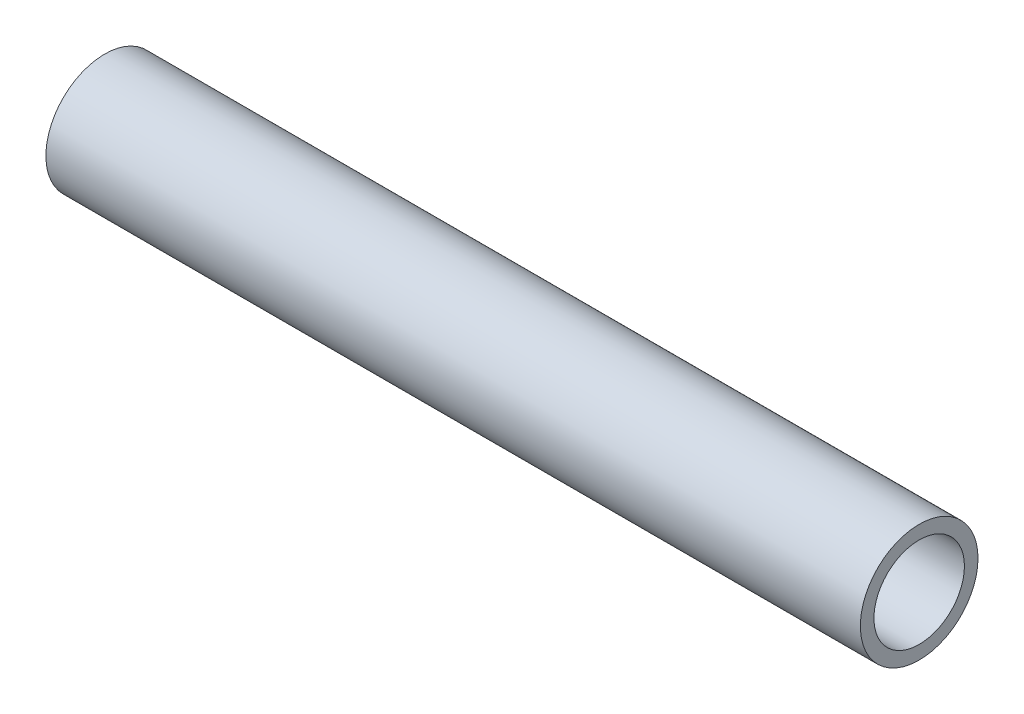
ISO-10303-21;
HEADER;
FILE_DESCRIPTION(('STEP AP214'),'2;1');
FILE_NAME('part.step','',(''),(''),'','','');
FILE_SCHEMA(('AUTOMOTIVE_DESIGN { 1 0 10303 214 1 1 1 1 }'));
ENDSEC;
DATA;
#1=APPLICATION_CONTEXT('core data for automotive mechanical design processes');
#2=APPLICATION_PROTOCOL_DEFINITION('international standard','automotive_design',2000,#1);
#3=PRODUCT_CONTEXT('',#1,'mechanical');
#4=PRODUCT('Part','Part','',(#3));
#5=PRODUCT_RELATED_PRODUCT_CATEGORY('part','',(#4));
#6=PRODUCT_DEFINITION_FORMATION('','',#4);
#7=PRODUCT_DEFINITION_CONTEXT('part definition',#1,'design');
#8=PRODUCT_DEFINITION('design','',#6,#7);
#9=PRODUCT_DEFINITION_SHAPE('','',#8);
#10=(LENGTH_UNIT() NAMED_UNIT(*) SI_UNIT(.MILLI.,.METRE.));
#11=(NAMED_UNIT(*) PLANE_ANGLE_UNIT() SI_UNIT($,.RADIAN.));
#12=(NAMED_UNIT(*) SI_UNIT($,.STERADIAN.) SOLID_ANGLE_UNIT());
#13=UNCERTAINTY_MEASURE_WITH_UNIT(LENGTH_MEASURE(1.E-05),#10,'distance_accuracy_value','');
#14=(GEOMETRIC_REPRESENTATION_CONTEXT(3) GLOBAL_UNCERTAINTY_ASSIGNED_CONTEXT((#13)) GLOBAL_UNIT_ASSIGNED_CONTEXT((#10,
#11,#12)) REPRESENTATION_CONTEXT('',''));
#15=CARTESIAN_POINT('',(0.,0.,0.));
#16=DIRECTION('',(0.,0.,1.));
#17=DIRECTION('',(1.,0.,0.));
#18=AXIS2_PLACEMENT_3D('',#15,#16,#17);
#19=CARTESIAN_POINT('',(228.6,-1.77635683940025E-12,0.));
#20=DIRECTION('',(-1.,0.,0.));
#21=DIRECTION('',(0.,0.,1.));
#22=AXIS2_PLACEMENT_3D('',#19,#20,#21);
#23=CYLINDRICAL_SURFACE('',#22,12.7);
#24=CARTESIAN_POINT('',(228.6,-1.77635683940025E-12,0.));
#25=DIRECTION('',(1.,0.,0.));
#26=DIRECTION('',(0.,0.,-1.));
#27=AXIS2_PLACEMENT_3D('',#24,#25,#26);
#28=CIRCLE('',#27,12.7);
#29=CARTESIAN_POINT('',(228.6,-1.77565184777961E-12,-12.6999999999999));
#30=VERTEX_POINT('',#29);
#31=EDGE_CURVE('E42',#30,#30,#28,.T.);
#32=ORIENTED_EDGE('',*,*,#31,.T.);
#33=EDGE_LOOP('',(#32));
#34=FACE_BOUND('',#33,.T.);
#35=CARTESIAN_POINT('',(0.,0.,0.));
#36=DIRECTION('',(1.,0.,0.));
#37=DIRECTION('',(0.,0.,-1.));
#38=AXIS2_PLACEMENT_3D('',#35,#36,#37);
#39=CIRCLE('',#38,12.7);
#40=CARTESIAN_POINT('',(0.,0.,-12.7));
#41=VERTEX_POINT('',#40);
#42=EDGE_CURVE('E48',#41,#41,#39,.T.);
#43=ORIENTED_EDGE('',*,*,#42,.F.);
#44=EDGE_LOOP('',(#43));
#45=FACE_BOUND('',#44,.T.);
#46=ADVANCED_FACE('F35',(#34,#45),#23,.F.);
#47=CARTESIAN_POINT('',(228.6,-1.77635683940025E-12,0.));
#48=DIRECTION('',(-1.,0.,0.));
#49=DIRECTION('',(0.,0.,1.));
#50=AXIS2_PLACEMENT_3D('',#47,#48,#49);
#51=CYLINDRICAL_SURFACE('',#50,16.51);
#52=CARTESIAN_POINT('',(228.6,-1.77635683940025E-12,0.));
#53=DIRECTION('',(1.,0.,0.));
#54=DIRECTION('',(0.,0.,-1.));
#55=AXIS2_PLACEMENT_3D('',#52,#53,#54);
#56=CIRCLE('',#55,16.51);
#57=CARTESIAN_POINT('',(228.6,-1.77544035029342E-12,-16.5099999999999));
#58=VERTEX_POINT('',#57);
#59=EDGE_CURVE('E10',#58,#58,#56,.T.);
#60=ORIENTED_EDGE('',*,*,#59,.F.);
#61=EDGE_LOOP('',(#60));
#62=FACE_BOUND('',#61,.T.);
#63=CARTESIAN_POINT('',(0.,0.,0.));
#64=DIRECTION('',(1.,0.,0.));
#65=DIRECTION('',(0.,0.,-1.));
#66=AXIS2_PLACEMENT_3D('',#63,#64,#65);
#67=CIRCLE('',#66,16.51);
#68=CARTESIAN_POINT('',(0.,0.,-16.51));
#69=VERTEX_POINT('',#68);
#70=EDGE_CURVE('E38',#69,#69,#67,.T.);
#71=ORIENTED_EDGE('',*,*,#70,.T.);
#72=EDGE_LOOP('',(#71));
#73=FACE_BOUND('',#72,.T.);
#74=ADVANCED_FACE('F55',(#62,#73),#51,.T.);
#75=CARTESIAN_POINT('',(228.6,-1.77635683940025E-12,0.));
#76=DIRECTION('',(1.,0.,0.));
#77=DIRECTION('',(0.,0.,-1.));
#78=AXIS2_PLACEMENT_3D('',#75,#76,#77);
#79=PLANE('',#78);
#80=ORIENTED_EDGE('',*,*,#31,.F.);
#81=EDGE_LOOP('',(#80));
#82=FACE_BOUND('',#81,.T.);
#83=ORIENTED_EDGE('',*,*,#59,.T.);
#84=EDGE_LOOP('',(#83));
#85=FACE_BOUND('',#84,.T.);
#86=ADVANCED_FACE('F59',(#82,#85),#79,.T.);
#87=CARTESIAN_POINT('',(0.,0.,0.));
#88=DIRECTION('',(1.,0.,0.));
#89=DIRECTION('',(0.,0.,-1.));
#90=AXIS2_PLACEMENT_3D('',#87,#88,#89);
#91=PLANE('',#90);
#92=ORIENTED_EDGE('',*,*,#42,.T.);
#93=EDGE_LOOP('',(#92));
#94=FACE_BOUND('',#93,.T.);
#95=ORIENTED_EDGE('',*,*,#70,.F.);
#96=EDGE_LOOP('',(#95));
#97=FACE_BOUND('',#96,.T.);
#98=ADVANCED_FACE('F57',(#94,#97),#91,.F.);
#99=CLOSED_SHELL('',(#46,#74,#86,#98));
#100=MANIFOLD_SOLID_BREP('B2',#99);
#101=ADVANCED_BREP_SHAPE_REPRESENTATION('',(#18,#100),#14);
#102=SHAPE_DEFINITION_REPRESENTATION(#9,#101);
ENDSEC;
END-ISO-10303-21;
